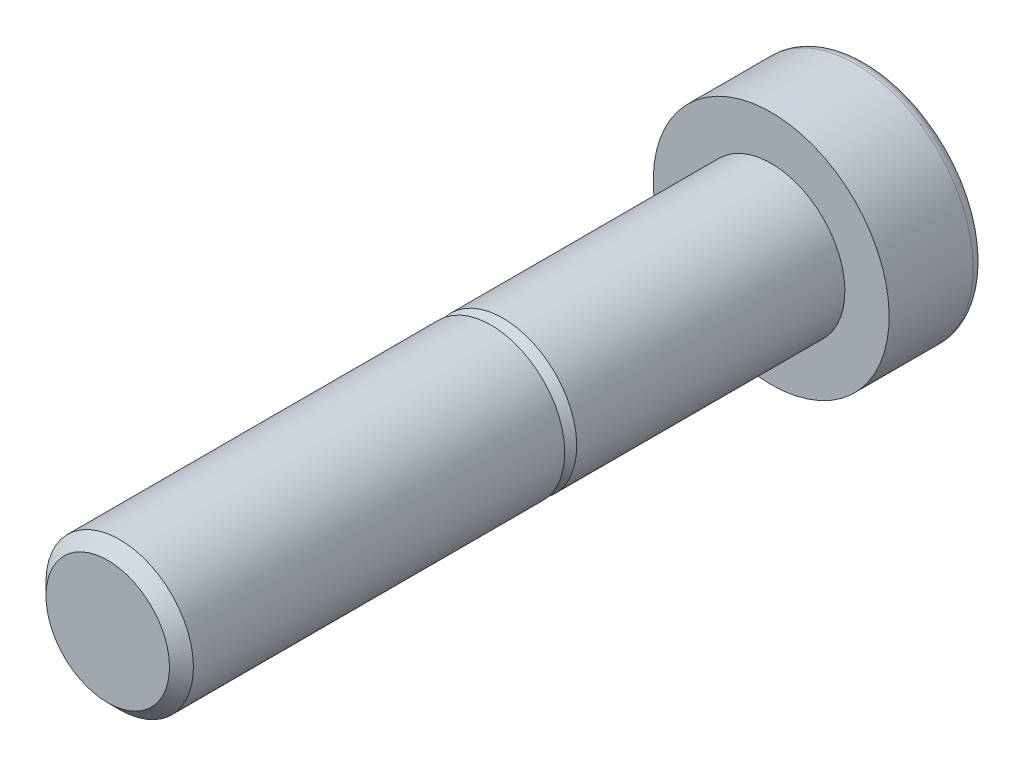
ISO-10303-21;
HEADER;
FILE_DESCRIPTION(('STEP AP214'),'2;1');
FILE_NAME('part.step','',(''),(''),'','','');
FILE_SCHEMA(('AUTOMOTIVE_DESIGN { 1 0 10303 214 1 1 1 1 }'));
ENDSEC;
DATA;
#1=APPLICATION_CONTEXT('core data for automotive mechanical design processes');
#2=APPLICATION_PROTOCOL_DEFINITION('international standard','automotive_design',2000,#1);
#3=PRODUCT_CONTEXT('',#1,'mechanical');
#4=PRODUCT('Part','Part','',(#3));
#5=PRODUCT_RELATED_PRODUCT_CATEGORY('part','',(#4));
#6=PRODUCT_DEFINITION_FORMATION('','',#4);
#7=PRODUCT_DEFINITION_CONTEXT('part definition',#1,'design');
#8=PRODUCT_DEFINITION('design','',#6,#7);
#9=PRODUCT_DEFINITION_SHAPE('','',#8);
#10=(LENGTH_UNIT() NAMED_UNIT(*) SI_UNIT(.MILLI.,.METRE.));
#11=(NAMED_UNIT(*) PLANE_ANGLE_UNIT() SI_UNIT($,.RADIAN.));
#12=(NAMED_UNIT(*) SI_UNIT($,.STERADIAN.) SOLID_ANGLE_UNIT());
#13=UNCERTAINTY_MEASURE_WITH_UNIT(LENGTH_MEASURE(1.E-05),#10,'distance_accuracy_value','');
#14=(GEOMETRIC_REPRESENTATION_CONTEXT(3) GLOBAL_UNCERTAINTY_ASSIGNED_CONTEXT((#13)) GLOBAL_UNIT_ASSIGNED_CONTEXT((#10,
#11,#12)) REPRESENTATION_CONTEXT('',''));
#15=CARTESIAN_POINT('',(0.,0.,0.));
#16=DIRECTION('',(0.,0.,1.));
#17=DIRECTION('',(1.,0.,0.));
#18=AXIS2_PLACEMENT_3D('',#15,#16,#17);
#19=CARTESIAN_POINT('',(4.61880215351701,0.,-3.15000009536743));
#20=DIRECTION('',(0.,0.,1.));
#21=DIRECTION('',(0.,-1.,0.));
#22=AXIS2_PLACEMENT_3D('',#19,#20,#21);
#23=PLANE('',#22);
#24=CARTESIAN_POINT('',(0.,0.,-3.15000009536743));
#25=DIRECTION('',(0.,0.,1.));
#26=DIRECTION('',(0.,-1.,0.));
#27=AXIS2_PLACEMENT_3D('',#24,#25,#26);
#28=CIRCLE('',#27,4.);
#29=CARTESIAN_POINT('',(0.,-4.,-3.15000009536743));
#30=VERTEX_POINT('',#29);
#31=CARTESIAN_POINT('',(-3.46410161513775,-2.,-3.15000009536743));
#32=VERTEX_POINT('',#31);
#33=EDGE_CURVE('E9',#30,#32,#28,.F.);
#34=ORIENTED_EDGE('',*,*,#33,.F.);
#35=DIRECTION('',(1.,0.,0.));
#36=VECTOR('',#35,1.);
#37=CARTESIAN_POINT('',(-2.30940107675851,-4.,-3.15000009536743));
#38=LINE('',#37,#36);
#39=CARTESIAN_POINT('',(-2.30940107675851,-4.,-3.15000009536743));
#40=VERTEX_POINT('',#39);
#41=EDGE_CURVE('E151',#40,#30,#38,.T.);
#42=ORIENTED_EDGE('',*,*,#41,.F.);
#43=DIRECTION('',(0.5,-0.866025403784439,0.));
#44=VECTOR('',#43,1.);
#45=CARTESIAN_POINT('',(-4.61880215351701,0.,-3.15000009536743));
#46=LINE('',#45,#44);
#47=EDGE_CURVE('E145',#32,#40,#46,.T.);
#48=ORIENTED_EDGE('',*,*,#47,.F.);
#49=EDGE_LOOP('',(#34,#42,#48));
#50=FACE_BOUND('',#49,.T.);
#51=ADVANCED_FACE('F14',(#50),#23,.F.);
#52=CARTESIAN_POINT('',(-3.46410161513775,2.,-3.15000009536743));
#53=VERTEX_POINT('',#52);
#54=EDGE_CURVE('E23',#32,#53,#28,.F.);
#55=ORIENTED_EDGE('',*,*,#54,.F.);
#56=CARTESIAN_POINT('',(-4.61880215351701,0.,-3.15000009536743));
#57=VERTEX_POINT('',#56);
#58=EDGE_CURVE('E146',#57,#32,#46,.T.);
#59=ORIENTED_EDGE('',*,*,#58,.F.);
#60=DIRECTION('',(-0.5,-0.866025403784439,0.));
#61=VECTOR('',#60,1.);
#62=CARTESIAN_POINT('',(-2.3094010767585,4.,-3.15000009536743));
#63=LINE('',#62,#61);
#64=EDGE_CURVE('E140',#53,#57,#63,.T.);
#65=ORIENTED_EDGE('',*,*,#64,.F.);
#66=EDGE_LOOP('',(#55,#59,#65));
#67=FACE_BOUND('',#66,.T.);
#68=ADVANCED_FACE('F244',(#67),#23,.F.);
#69=CARTESIAN_POINT('',(0.,4.,-3.15000009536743));
#70=VERTEX_POINT('',#69);
#71=EDGE_CURVE('E222',#53,#70,#28,.F.);
#72=ORIENTED_EDGE('',*,*,#71,.F.);
#73=CARTESIAN_POINT('',(-2.3094010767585,4.,-3.15000009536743));
#74=VERTEX_POINT('',#73);
#75=EDGE_CURVE('E141',#74,#53,#63,.T.);
#76=ORIENTED_EDGE('',*,*,#75,.F.);
#77=DIRECTION('',(-1.,0.,0.));
#78=VECTOR('',#77,1.);
#79=CARTESIAN_POINT('',(2.30940107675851,4.,-3.15000009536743));
#80=LINE('',#79,#78);
#81=EDGE_CURVE('E134',#70,#74,#80,.T.);
#82=ORIENTED_EDGE('',*,*,#81,.F.);
#83=EDGE_LOOP('',(#72,#76,#82));
#84=FACE_BOUND('',#83,.T.);
#85=ADVANCED_FACE('F243',(#84),#23,.F.);
#86=CARTESIAN_POINT('',(3.46410161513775,2.,-3.15000009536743));
#87=VERTEX_POINT('',#86);
#88=EDGE_CURVE('E218',#70,#87,#28,.F.);
#89=ORIENTED_EDGE('',*,*,#88,.F.);
#90=CARTESIAN_POINT('',(2.30940107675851,4.,-3.15000009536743));
#91=VERTEX_POINT('',#90);
#92=EDGE_CURVE('E136',#91,#70,#80,.T.);
#93=ORIENTED_EDGE('',*,*,#92,.F.);
#94=DIRECTION('',(-0.5,0.866025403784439,0.));
#95=VECTOR('',#94,1.);
#96=CARTESIAN_POINT('',(4.61880215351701,0.,-3.15000009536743));
#97=LINE('',#96,#95);
#98=EDGE_CURVE('E135',#87,#91,#97,.T.);
#99=ORIENTED_EDGE('',*,*,#98,.F.);
#100=EDGE_LOOP('',(#89,#93,#99));
#101=FACE_BOUND('',#100,.T.);
#102=ADVANCED_FACE('F275',(#101),#23,.F.);
#103=CARTESIAN_POINT('',(3.46410161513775,-2.,-3.15000009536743));
#104=VERTEX_POINT('',#103);
#105=EDGE_CURVE('E24',#87,#104,#28,.F.);
#106=ORIENTED_EDGE('',*,*,#105,.F.);
#107=CARTESIAN_POINT('',(4.61880215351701,0.,-3.15000009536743));
#108=VERTEX_POINT('',#107);
#109=EDGE_CURVE('E130',#108,#87,#97,.T.);
#110=ORIENTED_EDGE('',*,*,#109,.F.);
#111=DIRECTION('',(0.5,0.866025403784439,0.));
#112=VECTOR('',#111,1.);
#113=CARTESIAN_POINT('',(2.3094010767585,-4.,-3.15000009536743));
#114=LINE('',#113,#112);
#115=EDGE_CURVE('E129',#104,#108,#114,.T.);
#116=ORIENTED_EDGE('',*,*,#115,.F.);
#117=EDGE_LOOP('',(#106,#110,#116));
#118=FACE_BOUND('',#117,.T.);
#119=ADVANCED_FACE('F270',(#118),#23,.F.);
#120=CARTESIAN_POINT('',(0.,0.,-3.15000009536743));
#121=DIRECTION('',(0.,0.,1.));
#122=DIRECTION('',(0.,-1.,0.));
#123=AXIS2_PLACEMENT_3D('',#120,#121,#122);
#124=CIRCLE('',#123,4.);
#125=EDGE_CURVE('E110',#30,#104,#124,.T.);
#126=ORIENTED_EDGE('',*,*,#125,.T.);
#127=CARTESIAN_POINT('',(2.3094010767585,-4.,-3.15000009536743));
#128=VERTEX_POINT('',#127);
#129=EDGE_CURVE('E155',#128,#104,#114,.T.);
#130=ORIENTED_EDGE('',*,*,#129,.F.);
#131=EDGE_CURVE('E150',#30,#128,#38,.T.);
#132=ORIENTED_EDGE('',*,*,#131,.F.);
#133=EDGE_LOOP('',(#126,#130,#132));
#134=FACE_BOUND('',#133,.T.);
#135=ADVANCED_FACE('F283',(#134),#23,.F.);
#136=CARTESIAN_POINT('',(0.,0.,0.));
#137=DIRECTION('',(0.,0.,-1.));
#138=DIRECTION('',(0.,-1.,0.));
#139=AXIS2_PLACEMENT_3D('',#136,#137,#138);
#140=PLANE('',#139);
#141=CARTESIAN_POINT('',(0.,0.,0.));
#142=DIRECTION('',(0.,0.,-1.));
#143=DIRECTION('',(0.,-1.,0.));
#144=AXIS2_PLACEMENT_3D('',#141,#142,#143);
#145=CIRCLE('',#144,8.);
#146=CARTESIAN_POINT('',(0.,-8.,0.));
#147=VERTEX_POINT('',#146);
#148=EDGE_CURVE('E189',#147,#147,#145,.T.);
#149=ORIENTED_EDGE('',*,*,#148,.F.);
#150=EDGE_LOOP('',(#149));
#151=FACE_BOUND('',#150,.T.);
#152=CARTESIAN_POINT('',(0.,0.,0.));
#153=DIRECTION('',(0.,0.,-1.));
#154=DIRECTION('',(0.,-1.,0.));
#155=AXIS2_PLACEMENT_3D('',#152,#153,#154);
#156=CIRCLE('',#155,5.);
#157=CARTESIAN_POINT('',(0.,-5.,0.));
#158=VERTEX_POINT('',#157);
#159=EDGE_CURVE('E210',#158,#158,#156,.F.);
#160=ORIENTED_EDGE('',*,*,#159,.F.);
#161=EDGE_LOOP('',(#160));
#162=FACE_BOUND('',#161,.T.);
#163=ADVANCED_FACE('F292',(#151,#162),#140,.F.);
#164=CARTESIAN_POINT('',(-7.2,0.,-6.5));
#165=DIRECTION('',(0.,0.,1.));
#166=DIRECTION('',(0.,1.,0.));
#167=AXIS2_PLACEMENT_3D('',#164,#165,#166);
#168=PLANE('',#167);
#169=CARTESIAN_POINT('',(0.,0.,-6.5));
#170=DIRECTION('',(0.,0.,-1.));
#171=DIRECTION('',(0.,-1.,0.));
#172=AXIS2_PLACEMENT_3D('',#169,#170,#171);
#173=CIRCLE('',#172,7.2);
#174=CARTESIAN_POINT('',(0.,-7.2,-6.5));
#175=VERTEX_POINT('',#174);
#176=EDGE_CURVE('E181',#175,#175,#173,.T.);
#177=ORIENTED_EDGE('',*,*,#176,.T.);
#178=EDGE_LOOP('',(#177));
#179=FACE_BOUND('',#178,.T.);
#180=DIRECTION('',(-0.5,-0.866025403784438,0.));
#181=VECTOR('',#180,1.);
#182=CARTESIAN_POINT('',(1.66410161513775,-5.11769145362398,-6.5));
#183=LINE('',#182,#181);
#184=CARTESIAN_POINT('',(4.61880215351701,0.,-6.5));
#185=VERTEX_POINT('',#184);
#186=CARTESIAN_POINT('',(2.3094010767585,-4.,-6.5));
#187=VERTEX_POINT('',#186);
#188=EDGE_CURVE('E208',#185,#187,#183,.T.);
#189=ORIENTED_EDGE('',*,*,#188,.F.);
#190=DIRECTION('',(0.5,-0.866025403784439,0.));
#191=VECTOR('',#190,1.);
#192=CARTESIAN_POINT('',(1.66410161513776,5.11769145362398,-6.5));
#193=LINE('',#192,#191);
#194=CARTESIAN_POINT('',(2.30940107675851,4.,-6.5));
#195=VERTEX_POINT('',#194);
#196=EDGE_CURVE('E205',#195,#185,#193,.T.);
#197=ORIENTED_EDGE('',*,*,#196,.F.);
#198=DIRECTION('',(1.,0.,0.));
#199=VECTOR('',#198,1.);
#200=CARTESIAN_POINT('',(-7.2,4.,-6.5));
#201=LINE('',#200,#199);
#202=CARTESIAN_POINT('',(-2.3094010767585,4.,-6.5));
#203=VERTEX_POINT('',#202);
#204=EDGE_CURVE('E202',#203,#195,#201,.T.);
#205=ORIENTED_EDGE('',*,*,#204,.F.);
#206=DIRECTION('',(0.5,0.866025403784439,0.));
#207=VECTOR('',#206,1.);
#208=CARTESIAN_POINT('',(-5.26410161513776,-1.11769145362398,-6.5));
#209=LINE('',#208,#207);
#210=CARTESIAN_POINT('',(-4.61880215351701,0.,-6.5));
#211=VERTEX_POINT('',#210);
#212=EDGE_CURVE('E199',#211,#203,#209,.T.);
#213=ORIENTED_EDGE('',*,*,#212,.F.);
#214=DIRECTION('',(-0.5,0.866025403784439,0.));
#215=VECTOR('',#214,1.);
#216=CARTESIAN_POINT('',(-5.26410161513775,1.11769145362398,-6.5));
#217=LINE('',#216,#215);
#218=CARTESIAN_POINT('',(-2.30940107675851,-4.,-6.5));
#219=VERTEX_POINT('',#218);
#220=EDGE_CURVE('E196',#219,#211,#217,.T.);
#221=ORIENTED_EDGE('',*,*,#220,.F.);
#222=DIRECTION('',(-1.,0.,0.));
#223=VECTOR('',#222,1.);
#224=CARTESIAN_POINT('',(-7.2,-4.,-6.5));
#225=LINE('',#224,#223);
#226=EDGE_CURVE('E193',#187,#219,#225,.T.);
#227=ORIENTED_EDGE('',*,*,#226,.F.);
#228=EDGE_LOOP('',(#189,#197,#205,#213,#221,#227));
#229=FACE_BOUND('',#228,.T.);
#230=ADVANCED_FACE('F16',(#179,#229),#168,.F.);
#231=CARTESIAN_POINT('',(0.,0.,-6.5));
#232=DIRECTION('',(0.,0.,-1.));
#233=DIRECTION('',(0.,-1.,0.));
#234=AXIS2_PLACEMENT_3D('',#231,#232,#233);
#235=CYLINDRICAL_SURFACE('',#234,8.);
#236=CARTESIAN_POINT('',(0.,0.,-5.7));
#237=DIRECTION('',(0.,0.,-1.));
#238=DIRECTION('',(0.,-1.,0.));
#239=AXIS2_PLACEMENT_3D('',#236,#237,#238);
#240=CIRCLE('',#239,8.);
#241=CARTESIAN_POINT('',(0.,-8.,-5.7));
#242=VERTEX_POINT('',#241);
#243=EDGE_CURVE('E185',#242,#242,#240,.T.);
#244=ORIENTED_EDGE('',*,*,#243,.F.);
#245=EDGE_LOOP('',(#244));
#246=FACE_BOUND('',#245,.T.);
#247=ORIENTED_EDGE('',*,*,#148,.T.);
#248=EDGE_LOOP('',(#247));
#249=FACE_BOUND('',#248,.T.);
#250=ADVANCED_FACE('F326',(#246,#249),#235,.T.);
#251=CARTESIAN_POINT('',(0.,0.,-5.7));
#252=DIRECTION('',(0.,0.,-1.));
#253=DIRECTION('',(0.,-1.,0.));
#254=AXIS2_PLACEMENT_3D('',#251,#252,#253);
#255=TOROIDAL_SURFACE('',#254,7.2,0.8);
#256=ORIENTED_EDGE('',*,*,#176,.F.);
#257=EDGE_LOOP('',(#256));
#258=FACE_BOUND('',#257,.T.);
#259=ORIENTED_EDGE('',*,*,#243,.T.);
#260=EDGE_LOOP('',(#259));
#261=FACE_BOUND('',#260,.T.);
#262=ADVANCED_FACE('F335',(#258,#261),#255,.T.);
#263=CARTESIAN_POINT('',(2.3094010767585,-4.,-3.15000009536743));
#264=DIRECTION('',(-0.866025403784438,0.5,0.));
#265=DIRECTION('',(-0.5,-0.866025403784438,0.));
#266=AXIS2_PLACEMENT_3D('',#263,#264,#265);
#267=PLANE('',#266);
#268=ORIENTED_EDGE('',*,*,#188,.T.);
#269=DIRECTION('',(0.,0.,-1.));
#270=VECTOR('',#269,1.);
#271=CARTESIAN_POINT('',(2.3094010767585,-4.,-3.15000009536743));
#272=LINE('',#271,#270);
#273=EDGE_CURVE('E38',#128,#187,#272,.T.);
#274=ORIENTED_EDGE('',*,*,#273,.F.);
#275=ORIENTED_EDGE('',*,*,#129,.T.);
#276=ORIENTED_EDGE('',*,*,#115,.T.);
#277=DIRECTION('',(0.,0.,-1.));
#278=VECTOR('',#277,1.);
#279=CARTESIAN_POINT('',(4.61880215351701,0.,-3.15000009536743));
#280=LINE('',#279,#278);
#281=EDGE_CURVE('E177',#108,#185,#280,.T.);
#282=ORIENTED_EDGE('',*,*,#281,.T.);
#283=EDGE_LOOP('',(#268,#274,#275,#276,#282));
#284=FACE_BOUND('',#283,.T.);
#285=ADVANCED_FACE('F264',(#284),#267,.T.);
#286=CARTESIAN_POINT('',(4.61880215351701,0.,-3.15000009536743));
#287=DIRECTION('',(-0.866025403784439,-0.5,0.));
#288=DIRECTION('',(0.5,-0.866025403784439,0.));
#289=AXIS2_PLACEMENT_3D('',#286,#287,#288);
#290=PLANE('',#289);
#291=ORIENTED_EDGE('',*,*,#196,.T.);
#292=ORIENTED_EDGE('',*,*,#281,.F.);
#293=ORIENTED_EDGE('',*,*,#109,.T.);
#294=ORIENTED_EDGE('',*,*,#98,.T.);
#295=DIRECTION('',(0.,0.,-1.));
#296=VECTOR('',#295,1.);
#297=CARTESIAN_POINT('',(2.30940107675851,4.,-3.15000009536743));
#298=LINE('',#297,#296);
#299=EDGE_CURVE('E173',#91,#195,#298,.T.);
#300=ORIENTED_EDGE('',*,*,#299,.T.);
#301=EDGE_LOOP('',(#291,#292,#293,#294,#300));
#302=FACE_BOUND('',#301,.T.);
#303=ADVANCED_FACE('F262',(#302),#290,.T.);
#304=CARTESIAN_POINT('',(2.30940107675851,4.,-3.15000009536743));
#305=DIRECTION('',(0.,-1.,0.));
#306=DIRECTION('',(1.,0.,0.));
#307=AXIS2_PLACEMENT_3D('',#304,#305,#306);
#308=PLANE('',#307);
#309=ORIENTED_EDGE('',*,*,#204,.T.);
#310=ORIENTED_EDGE('',*,*,#299,.F.);
#311=ORIENTED_EDGE('',*,*,#92,.T.);
#312=ORIENTED_EDGE('',*,*,#81,.T.);
#313=DIRECTION('',(0.,0.,-1.));
#314=VECTOR('',#313,1.);
#315=CARTESIAN_POINT('',(-2.3094010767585,4.,-3.15000009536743));
#316=LINE('',#315,#314);
#317=EDGE_CURVE('E169',#74,#203,#316,.T.);
#318=ORIENTED_EDGE('',*,*,#317,.T.);
#319=EDGE_LOOP('',(#309,#310,#311,#312,#318));
#320=FACE_BOUND('',#319,.T.);
#321=ADVANCED_FACE('F253',(#320),#308,.T.);
#322=CARTESIAN_POINT('',(-2.3094010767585,4.,-3.15000009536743));
#323=DIRECTION('',(0.866025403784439,-0.5,0.));
#324=DIRECTION('',(0.5,0.866025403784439,0.));
#325=AXIS2_PLACEMENT_3D('',#322,#323,#324);
#326=PLANE('',#325);
#327=ORIENTED_EDGE('',*,*,#212,.T.);
#328=ORIENTED_EDGE('',*,*,#317,.F.);
#329=ORIENTED_EDGE('',*,*,#75,.T.);
#330=ORIENTED_EDGE('',*,*,#64,.T.);
#331=DIRECTION('',(0.,0.,-1.));
#332=VECTOR('',#331,1.);
#333=CARTESIAN_POINT('',(-4.61880215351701,0.,-3.15000009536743));
#334=LINE('',#333,#332);
#335=EDGE_CURVE('E165',#57,#211,#334,.T.);
#336=ORIENTED_EDGE('',*,*,#335,.T.);
#337=EDGE_LOOP('',(#327,#328,#329,#330,#336));
#338=FACE_BOUND('',#337,.T.);
#339=ADVANCED_FACE('F249',(#338),#326,.T.);
#340=CARTESIAN_POINT('',(-4.61880215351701,0.,-3.15000009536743));
#341=DIRECTION('',(0.866025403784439,0.5,0.));
#342=DIRECTION('',(-0.5,0.866025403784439,0.));
#343=AXIS2_PLACEMENT_3D('',#340,#341,#342);
#344=PLANE('',#343);
#345=ORIENTED_EDGE('',*,*,#220,.T.);
#346=ORIENTED_EDGE('',*,*,#335,.F.);
#347=ORIENTED_EDGE('',*,*,#58,.T.);
#348=ORIENTED_EDGE('',*,*,#47,.T.);
#349=DIRECTION('',(0.,0.,-1.));
#350=VECTOR('',#349,1.);
#351=CARTESIAN_POINT('',(-2.30940107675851,-4.,-3.15000009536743));
#352=LINE('',#351,#350);
#353=EDGE_CURVE('E161',#40,#219,#352,.T.);
#354=ORIENTED_EDGE('',*,*,#353,.T.);
#355=EDGE_LOOP('',(#345,#346,#347,#348,#354));
#356=FACE_BOUND('',#355,.T.);
#357=ADVANCED_FACE('F378',(#356),#344,.T.);
#358=CARTESIAN_POINT('',(-2.30940107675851,-4.,-3.15000009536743));
#359=DIRECTION('',(0.,1.,0.));
#360=DIRECTION('',(-1.,0.,0.));
#361=AXIS2_PLACEMENT_3D('',#358,#359,#360);
#362=PLANE('',#361);
#363=ORIENTED_EDGE('',*,*,#226,.T.);
#364=ORIENTED_EDGE('',*,*,#353,.F.);
#365=ORIENTED_EDGE('',*,*,#41,.T.);
#366=ORIENTED_EDGE('',*,*,#131,.T.);
#367=ORIENTED_EDGE('',*,*,#273,.T.);
#368=EDGE_LOOP('',(#363,#364,#365,#366,#367));
#369=FACE_BOUND('',#368,.T.);
#370=ADVANCED_FACE('F387',(#369),#362,.T.);
#371=CARTESIAN_POINT('',(0.,0.,0.));
#372=DIRECTION('',(0.,0.,-1.));
#373=DIRECTION('',(0.,-1.,0.));
#374=AXIS2_PLACEMENT_3D('',#371,#372,#373);
#375=CYLINDRICAL_SURFACE('',#374,5.);
#376=CARTESIAN_POINT('',(0.,0.,18.1882132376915));
#377=DIRECTION('',(0.,0.,-1.));
#378=DIRECTION('',(0.,-1.,0.));
#379=AXIS2_PLACEMENT_3D('',#376,#377,#378);
#380=CIRCLE('',#379,5.);
#381=CARTESIAN_POINT('',(0.,-5.,18.1882132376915));
#382=VERTEX_POINT('',#381);
#383=EDGE_CURVE('E97',#382,#382,#380,.T.);
#384=ORIENTED_EDGE('',*,*,#383,.T.);
#385=EDGE_LOOP('',(#384));
#386=FACE_BOUND('',#385,.T.);
#387=ORIENTED_EDGE('',*,*,#159,.T.);
#388=EDGE_LOOP('',(#387));
#389=FACE_BOUND('',#388,.T.);
#390=ADVANCED_FACE('F397',(#386,#389),#375,.T.);
#391=CARTESIAN_POINT('',(0.,0.,45.));
#392=DIRECTION('',(0.,0.,-1.));
#393=DIRECTION('',(0.,-1.,0.));
#394=AXIS2_PLACEMENT_3D('',#391,#392,#393);
#395=PLANE('',#394);
#396=CARTESIAN_POINT('',(0.,0.,45.));
#397=DIRECTION('',(0.,0.,-1.));
#398=DIRECTION('',(0.,-1.,0.));
#399=AXIS2_PLACEMENT_3D('',#396,#397,#398);
#400=CIRCLE('',#399,4.18821323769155);
#401=CARTESIAN_POINT('',(0.,-4.18821323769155,45.));
#402=VERTEX_POINT('',#401);
#403=EDGE_CURVE('E125',#402,#402,#400,.T.);
#404=ORIENTED_EDGE('',*,*,#403,.F.);
#405=EDGE_LOOP('',(#404));
#406=FACE_BOUND('',#405,.T.);
#407=ADVANCED_FACE('F405',(#406),#395,.F.);
#408=CARTESIAN_POINT('',(0.,0.,45.));
#409=DIRECTION('',(0.,0.,-1.));
#410=DIRECTION('',(0.,-1.,0.));
#411=AXIS2_PLACEMENT_3D('',#408,#409,#410);
#412=CONICAL_SURFACE('',#411,4.18821323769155,0.78539816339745);
#413=CARTESIAN_POINT('',(0.,0.,44.1882132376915));
#414=DIRECTION('',(0.,0.,-1.));
#415=DIRECTION('',(0.,-1.,0.));
#416=AXIS2_PLACEMENT_3D('',#413,#414,#415);
#417=CIRCLE('',#416,5.);
#418=CARTESIAN_POINT('',(0.,-5.,44.1882132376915));
#419=VERTEX_POINT('',#418);
#420=EDGE_CURVE('E121',#419,#419,#417,.T.);
#421=ORIENTED_EDGE('',*,*,#420,.F.);
#422=EDGE_LOOP('',(#421));
#423=FACE_BOUND('',#422,.T.);
#424=ORIENTED_EDGE('',*,*,#403,.T.);
#425=EDGE_LOOP('',(#424));
#426=FACE_BOUND('',#425,.T.);
#427=ADVANCED_FACE('F415',(#423,#426),#412,.T.);
#428=CARTESIAN_POINT('',(0.,0.,0.));
#429=DIRECTION('',(0.,0.,-1.));
#430=DIRECTION('',(0.,-1.,0.));
#431=AXIS2_PLACEMENT_3D('',#428,#429,#430);
#432=CYLINDRICAL_SURFACE('',#431,5.);
#433=CARTESIAN_POINT('',(0.,0.,19.));
#434=DIRECTION('',(0.,0.,-1.));
#435=DIRECTION('',(0.,-1.,0.));
#436=AXIS2_PLACEMENT_3D('',#433,#434,#435);
#437=CIRCLE('',#436,5.);
#438=CARTESIAN_POINT('',(0.,-5.,19.));
#439=VERTEX_POINT('',#438);
#440=EDGE_CURVE('E117',#439,#439,#437,.T.);
#441=ORIENTED_EDGE('',*,*,#440,.F.);
#442=EDGE_LOOP('',(#441));
#443=FACE_BOUND('',#442,.T.);
#444=ORIENTED_EDGE('',*,*,#420,.T.);
#445=EDGE_LOOP('',(#444));
#446=FACE_BOUND('',#445,.T.);
#447=ADVANCED_FACE('F424',(#443,#446),#432,.T.);
#448=CARTESIAN_POINT('',(-5.,0.,19.));
#449=DIRECTION('',(0.,0.,1.));
#450=DIRECTION('',(0.,1.,0.));
#451=AXIS2_PLACEMENT_3D('',#448,#449,#450);
#452=PLANE('',#451);
#453=CARTESIAN_POINT('',(0.,0.,19.));
#454=DIRECTION('',(0.,0.,-1.));
#455=DIRECTION('',(0.,-1.,0.));
#456=AXIS2_PLACEMENT_3D('',#453,#454,#455);
#457=CIRCLE('',#456,4.18821323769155);
#458=CARTESIAN_POINT('',(0.,-4.18821323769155,19.));
#459=VERTEX_POINT('',#458);
#460=EDGE_CURVE('E106',#459,#459,#457,.T.);
#461=ORIENTED_EDGE('',*,*,#460,.F.);
#462=EDGE_LOOP('',(#461));
#463=FACE_BOUND('',#462,.T.);
#464=ORIENTED_EDGE('',*,*,#440,.T.);
#465=EDGE_LOOP('',(#464));
#466=FACE_BOUND('',#465,.T.);
#467=ADVANCED_FACE('F434',(#463,#466),#452,.F.);
#468=CARTESIAN_POINT('',(0.,0.,19.));
#469=DIRECTION('',(0.,0.,-1.));
#470=DIRECTION('',(0.,-1.,0.));
#471=AXIS2_PLACEMENT_3D('',#468,#469,#470);
#472=CONICAL_SURFACE('',#471,4.18821323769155,0.785398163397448);
#473=ORIENTED_EDGE('',*,*,#383,.F.);
#474=EDGE_LOOP('',(#473));
#475=FACE_BOUND('',#474,.T.);
#476=ORIENTED_EDGE('',*,*,#460,.T.);
#477=EDGE_LOOP('',(#476));
#478=FACE_BOUND('',#477,.T.);
#479=ADVANCED_FACE('F90',(#475,#478),#472,.T.);
#480=CARTESIAN_POINT('',(0.,0.,-0.57337588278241));
#481=DIRECTION('',(0.,0.,-1.));
#482=DIRECTION('',(0.,1.,0.));
#483=AXIS2_PLACEMENT_3D('',#480,#481,#482);
#484=CONICAL_SURFACE('',#483,2.5,1.0471975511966);
#485=CARTESIAN_POINT('',(0.,0.,0.869999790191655));
#486=VERTEX_POINT('',#485);
#487=VERTEX_LOOP('',#486);
#488=FACE_BOUND('',#487,.T.);
#489=CARTESIAN_POINT('',(0.,0.,-0.57337588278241));
#490=DIRECTION('',(0.,0.,1.));
#491=DIRECTION('',(0.,-1.,0.));
#492=AXIS2_PLACEMENT_3D('',#489,#490,#491);
#493=CIRCLE('',#492,2.5);
#494=CARTESIAN_POINT('',(0.,-2.5,-0.57337588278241));
#495=VERTEX_POINT('',#494);
#496=EDGE_CURVE('E94',#495,#495,#493,.T.);
#497=ORIENTED_EDGE('',*,*,#496,.F.);
#498=EDGE_LOOP('',(#497));
#499=FACE_BOUND('',#498,.T.);
#500=ADVANCED_FACE('F86',(#488,#499),#484,.F.);
#501=CARTESIAN_POINT('',(0.,0.,-4.15000009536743));
#502=DIRECTION('',(0.,0.,1.));
#503=DIRECTION('',(0.,-1.,0.));
#504=AXIS2_PLACEMENT_3D('',#501,#502,#503);
#505=CYLINDRICAL_SURFACE('',#504,2.5);
#506=ORIENTED_EDGE('',*,*,#496,.T.);
#507=EDGE_LOOP('',(#506));
#508=FACE_BOUND('',#507,.T.);
#509=CARTESIAN_POINT('',(0.,0.,-2.28397469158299));
#510=DIRECTION('',(0.,0.,1.));
#511=DIRECTION('',(0.,-1.,0.));
#512=AXIS2_PLACEMENT_3D('',#509,#510,#511);
#513=CIRCLE('',#512,2.5);
#514=CARTESIAN_POINT('',(0.,-2.5,-2.28397469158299));
#515=VERTEX_POINT('',#514);
#516=EDGE_CURVE('E98',#515,#515,#513,.T.);
#517=ORIENTED_EDGE('',*,*,#516,.F.);
#518=EDGE_LOOP('',(#517));
#519=FACE_BOUND('',#518,.T.);
#520=ADVANCED_FACE('F89',(#508,#519),#505,.F.);
#521=CARTESIAN_POINT('',(0.,0.,-3.15000009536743));
#522=DIRECTION('',(0.,0.,-1.));
#523=DIRECTION('',(0.,1.,0.));
#524=AXIS2_PLACEMENT_3D('',#521,#522,#523);
#525=CONICAL_SURFACE('',#524,4.,1.0471975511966);
#526=ORIENTED_EDGE('',*,*,#516,.T.);
#527=EDGE_LOOP('',(#526));
#528=FACE_BOUND('',#527,.T.);
#529=ORIENTED_EDGE('',*,*,#125,.F.);
#530=ORIENTED_EDGE('',*,*,#33,.T.);
#531=ORIENTED_EDGE('',*,*,#54,.T.);
#532=ORIENTED_EDGE('',*,*,#71,.T.);
#533=ORIENTED_EDGE('',*,*,#88,.T.);
#534=ORIENTED_EDGE('',*,*,#105,.T.);
#535=EDGE_LOOP('',(#529,#530,#531,#532,#533,#534));
#536=FACE_BOUND('',#535,.T.);
#537=ADVANCED_FACE('F234',(#528,#536),#525,.F.);
#538=CLOSED_SHELL('',(#51,#68,#85,#102,#119,#135,#163,#230,#250,#262,#285,#303,#321,#339,#357,
#370,#390,#407,#427,#447,#467,#479,#500,#520,#537));
#539=MANIFOLD_SOLID_BREP('B1',#538);
#540=ADVANCED_BREP_SHAPE_REPRESENTATION('',(#18,#539),#14);
#541=SHAPE_DEFINITION_REPRESENTATION(#9,#540);
ENDSEC;
END-ISO-10303-21;
